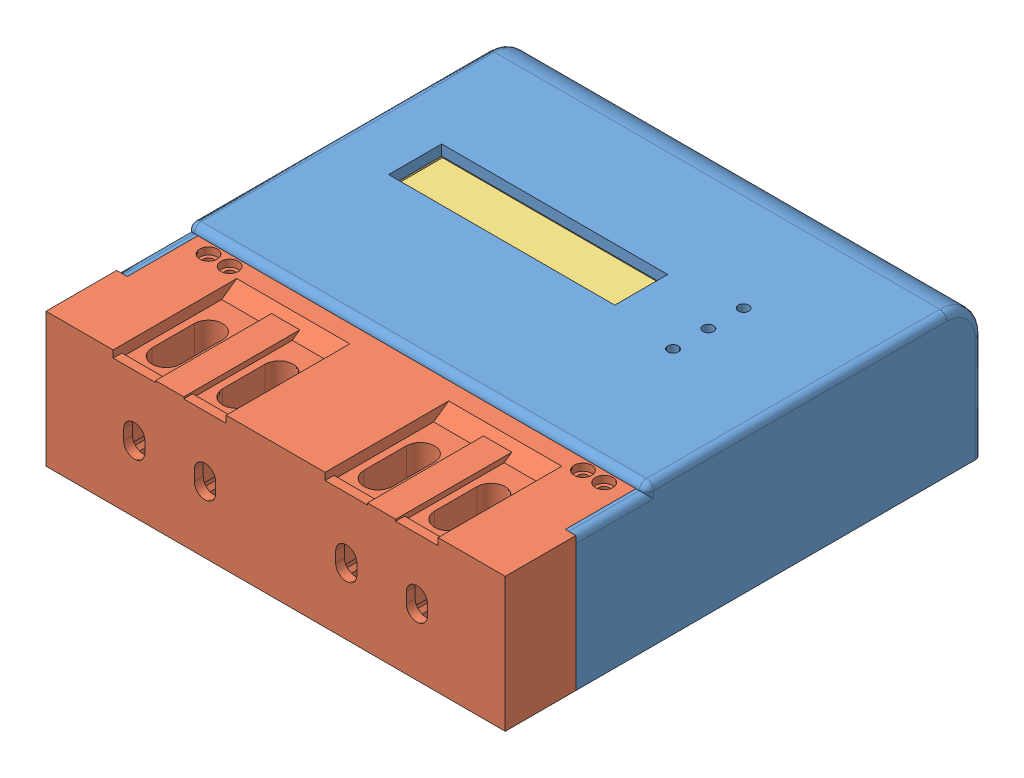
SolidWorks assembly ELECTRIC METER.SLDASM, configuration Default (file format 15000). Lengths in mm.
Overall size (130 40 135).
3 component instances, 3 part files, 6 mates.
Components (placement in the parent):
- Front Part-1: Front Part.SLDPRT [Default] at origin size (130 40 115)
- bottom part-1: bottom part.SLDPRT [Default] at (0 0 57.5) size (130 38 40)
- LCD 16X2-2: LCD 16X2.SLDPRT [Predeterminado] at (-16.2 28 -10.25) x (1 0 0) z (0 1 0) size (80.6 36 9)
Mates (geometry in assembly coordinates):
- Width1: width aligned: plane of bottom part-1 through (-62 38 37.5) normal (-1 0 0); plane of bottom part-1 through (62 38 37.5) normal (1 0 0); plane of Front Part-1 through (-65 40 -57.5) normal (-1 0 0); plane of Front Part-1 through (65 40 -57.5) normal (1 0 0)
- Coincident3: coincident aligned: plane of Front Part-1 through (0 0 0) normal (0 -1 0); plane of bottom part-1 through (0 0 57.5) normal (0 -1 0)
- Coincident4: coincident anti-aligned: plane of Front Part-1 through (-65 20 37.5) normal (0 0 1); plane of bottom part-1 through (-62 38 37.5) normal (0 0 -1)
- Coincident5: coincident anti-aligned: plane of Front Part-1 through (0 37 0) normal (0 -1 0); plane of LCD 16X2-2 through (-16.2 37 -10.25) normal (0 1 0)
- Width2: width anti-aligned: plane of LCD 16X2-2 through (-51.5 37 2.25) normal (0 0 1); plane of LCD 16X2-2 through (-51.5 37 -22.25) normal (0 0 -1); plane of Front Part-1 through (-48 -0.001 -2.5) normal (0 0 -1); plane of Front Part-1 through (-48 -0.001 -17.5) normal (0 0 1)
- Width3: width anti-aligned: plane of LCD 16X2-2 through (19.5 37 -22.25) normal (1 0 0); plane of LCD 16X2-2 through (-51.5 37 -22.25) normal (-1 0 0); plane of Front Part-1 through (16 -0.001 -2.5) normal (-1 0 0); plane of Front Part-1 through (-48 -0.001 -2.5) normal (1 0 0)
